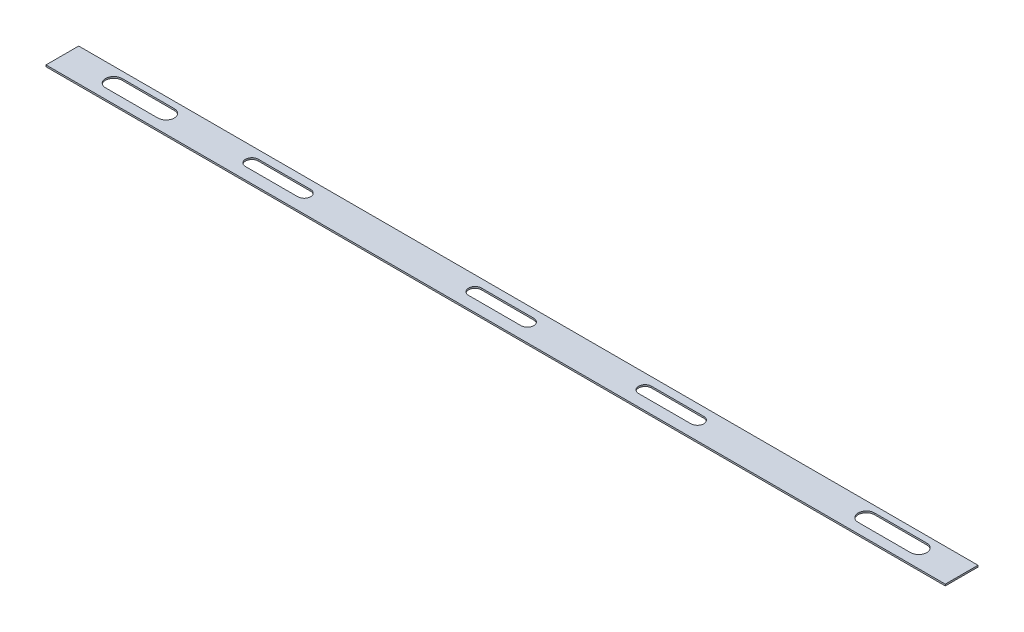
from build123d import *

# Parameters (mm, degrees)
SKETCH1_W           = 349.25
SKETCH1_H           = 12.7
BOSS_EXTRUDE1_DEPTH = 0.635
CUT_EXTRUDE2_DEPTH  = 350.481409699


with BuildPart() as part:
    # Sketch1 → Boss-Extrude1 (new body)
    with BuildSketch(Plane(origin=(0, 0, 0), x_dir=(1, 0, 0), z_dir=(0, 1, 0))):
        with Locations((174.625, 6.35)):
            Rectangle(SKETCH1_W, SKETCH1_H)
    extrude(amount=BOSS_EXTRUDE1_DEPTH)

    # Sketch4 → Cut-Extrude2 (cut, through all)
    with BuildSketch(Plane(origin=(0, 0.635, 0), x_dir=(1, 0, 0), z_dir=(0, 1, 0))):
        with BuildLine():
            Line((19.286736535, 10.204600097), (39.606736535, 10.204600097))
            ThreePointArc((39.606736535, 10.204600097), (42.781736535, 7.029600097), (39.606736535, 3.854600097))
            Line((39.606736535, 3.854600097), (19.286736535, 3.854600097))
            ThreePointArc((19.286736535, 3.854600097), (16.111736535, 7.029600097), (19.286736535, 10.204600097))
        make_face()
        with BuildLine():
            Line((72.93467965, 9.506100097), (93.25467965, 9.506100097))
            ThreePointArc((93.25467965, 9.506100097), (95.73117965, 7.029600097), (93.25467965, 4.553100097))
            Line((93.25467965, 4.553100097), (72.93467965, 4.553100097))
            ThreePointArc((72.93467965, 4.553100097), (70.45817965, 7.029600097), (72.93467965, 9.506100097))
        make_face()
        with BuildLine():
            Line((159.602261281, 9.518800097), (179.922261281, 9.518800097))
            ThreePointArc((179.922261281, 9.518800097), (182.411461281, 7.029600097), (179.922261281, 4.540400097))
            Line((179.922261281, 4.540400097), (159.602261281, 4.540400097))
            ThreePointArc((159.602261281, 4.540400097), (157.113061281, 7.029600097), (159.602261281, 9.518800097))
        make_face()
        with BuildLine():
            Line((225.616547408, 9.518800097), (245.936547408, 9.518800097))
            ThreePointArc((245.936547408, 9.518800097), (248.425747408, 7.029600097), (245.936547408, 4.540400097))
            Line((245.936547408, 4.540400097), (225.616547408, 4.540400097))
            ThreePointArc((225.616547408, 4.540400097), (223.127347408, 7.029600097), (225.616547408, 9.518800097))
        make_face()
        with BuildLine():
            Line((311.559674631, 10.204600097), (331.879674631, 10.204600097))
            ThreePointArc((331.879674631, 10.204600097), (335.054674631, 7.029600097), (331.879674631, 3.854600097))
            Line((331.879674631, 3.854600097), (311.559674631, 3.854600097))
            ThreePointArc((311.559674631, 3.854600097), (308.384674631, 7.029600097), (311.559674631, 10.204600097))
        make_face()
    extrude(amount=-CUT_EXTRUDE2_DEPTH, mode=Mode.SUBTRACT)


solid = part.part
